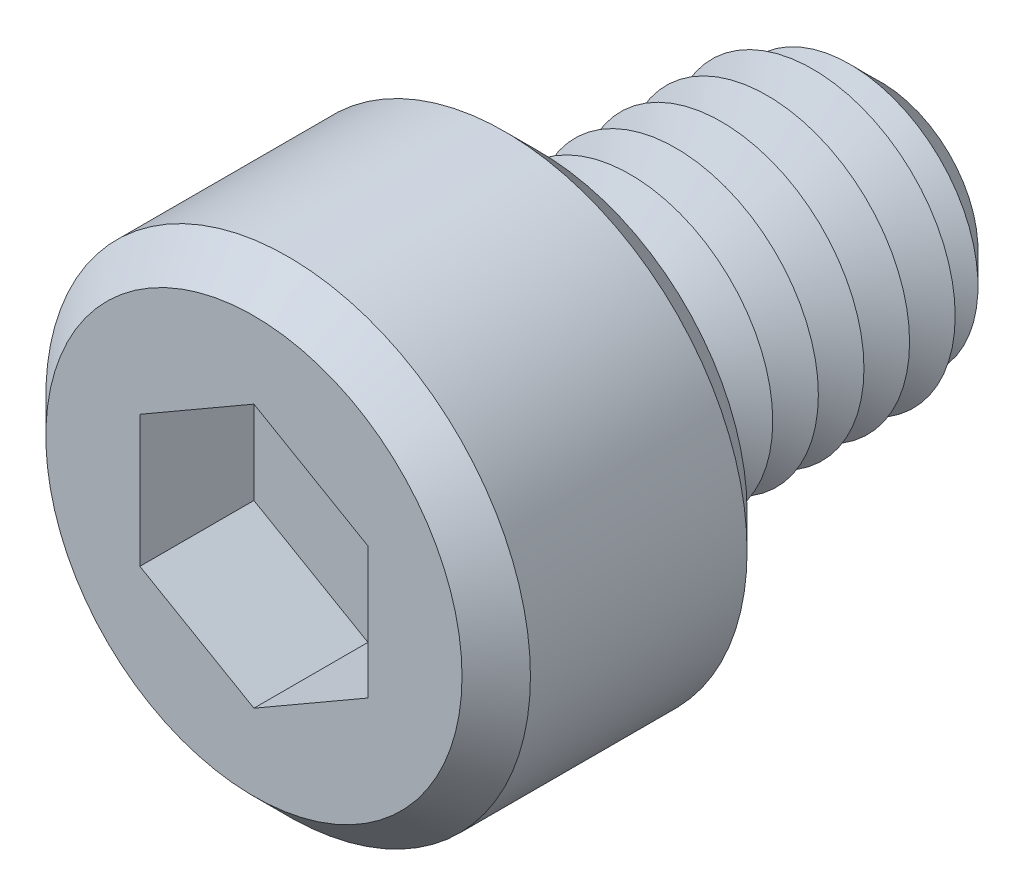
from build123d import *

# Parameters (mm, degrees)
SKETCH1_R           = 4.25
BOSS_EXTRUDE1_DEPTH = 5
SKETCH2_R           = 2.5
BOSS_EXTRUDE2_DEPTH = 6
CHAMFER1_SIZE       = 0.8
LPATTERN1_COUNT     = 7
LPATTERN1_PITCH     = 0.8
CUT_EXTRUDE1_DEPTH  = 2
SKETCH6_R           = 0.65
CUT_EXTRUDE2_DEPTH  = 9
CHAMFER2_SIZE       = 0.6


with BuildPart() as part:
    # Sketch1 → Boss-Extrude1 (new body)
    with BuildSketch(Plane.XY):
        Circle(SKETCH1_R)
    extrude(amount=BOSS_EXTRUDE1_DEPTH)

    # Sketch2 → Boss-Extrude2 (add)
    with BuildSketch(Plane(origin=(0, 0, 0), x_dir=(-1, 0, 0), z_dir=(0, 0, -1))):
        Circle(SKETCH2_R)
    extrude(amount=BOSS_EXTRUDE2_DEPTH)

    # Chamfer1
    chamfer1_edges = [part.edges().sort_by_distance(p)[0] for p in [
        (2.5, 0, -6),
    ]]
    chamfer(chamfer1_edges, length=CHAMFER1_SIZE)

    # Sketch4 → Cut-Revolve1 (revolve, cut)
    with BuildSketch(Plane(origin=(0, 0, 0), x_dir=(0, 0, -1), z_dir=(1, 0, 0)), mode=Mode.PRIVATE) as cut_revolve1_sk:
        Polygon((0, 2.5), (0.4, 1.807179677), (0.8, 2.5), align=None)
    cut_revolve1 = revolve(cut_revolve1_sk.sketch.rotate(Axis((0, 0, 2.512122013), (0, 0, -1)), 90), axis=Axis((0, 0, 2.512122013), (0, 0, -1)), mode=Mode.SUBTRACT)

    # LPattern1: Cut-Revolve1 ×7
    with Locations(*[(0, 0, -i * LPATTERN1_PITCH) for i in range(1, LPATTERN1_COUNT)]):
        add(cut_revolve1, mode=Mode.SUBTRACT)

    # Sketch5 → Cut-Extrude1 (cut)
    with BuildSketch(Plane.XY.offset(5)):
        Polygon((0, 2.309401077), (-2, 1.154700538), (-2, -1.154700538), (0, -2.309401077), (2, -1.154700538), (2, 1.154700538), align=None)
    extrude(amount=-CUT_EXTRUDE1_DEPTH, mode=Mode.SUBTRACT)

    # Sketch6 → Cut-Extrude2 (cut)
    with BuildSketch(Plane.XY.offset(3)):
        Circle(SKETCH6_R)
    extrude(amount=-CUT_EXTRUDE2_DEPTH, mode=Mode.SUBTRACT)

    # Chamfer2
    chamfer2_edges = [part.edges().sort_by_distance(p)[0] for p in [
        (-4.25, 0, 0),
        (-4.25, 0, 5),
    ]]
    chamfer(chamfer2_edges, length=CHAMFER2_SIZE)


solid = part.part
